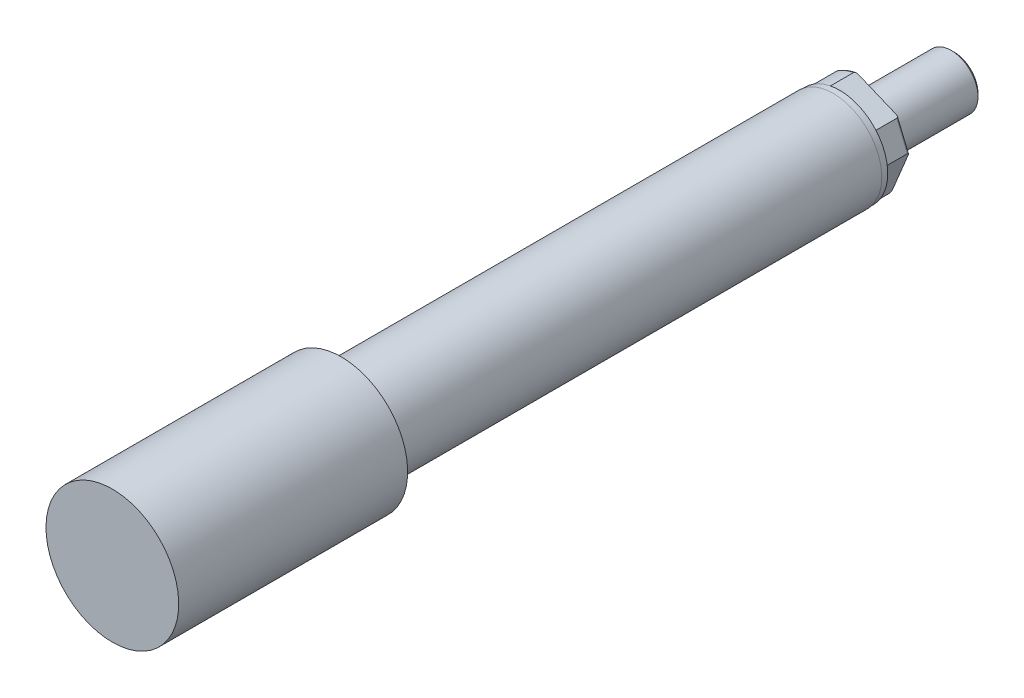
ISO-10303-21;
HEADER;
FILE_DESCRIPTION(('STEP AP214'),'2;1');
FILE_NAME('part.step','',(''),(''),'','','');
FILE_SCHEMA(('AUTOMOTIVE_DESIGN { 1 0 10303 214 1 1 1 1 }'));
ENDSEC;
DATA;
#1=APPLICATION_CONTEXT('core data for automotive mechanical design processes');
#2=APPLICATION_PROTOCOL_DEFINITION('international standard','automotive_design',2000,#1);
#3=PRODUCT_CONTEXT('',#1,'mechanical');
#4=PRODUCT('Part','Part','',(#3));
#5=PRODUCT_RELATED_PRODUCT_CATEGORY('part','',(#4));
#6=PRODUCT_DEFINITION_FORMATION('','',#4);
#7=PRODUCT_DEFINITION_CONTEXT('part definition',#1,'design');
#8=PRODUCT_DEFINITION('design','',#6,#7);
#9=PRODUCT_DEFINITION_SHAPE('','',#8);
#10=(LENGTH_UNIT() NAMED_UNIT(*) SI_UNIT(.MILLI.,.METRE.));
#11=(NAMED_UNIT(*) PLANE_ANGLE_UNIT() SI_UNIT($,.RADIAN.));
#12=(NAMED_UNIT(*) SI_UNIT($,.STERADIAN.) SOLID_ANGLE_UNIT());
#13=UNCERTAINTY_MEASURE_WITH_UNIT(LENGTH_MEASURE(1.E-05),#10,'distance_accuracy_value','');
#14=(GEOMETRIC_REPRESENTATION_CONTEXT(3) GLOBAL_UNCERTAINTY_ASSIGNED_CONTEXT((#13)) GLOBAL_UNIT_ASSIGNED_CONTEXT((#10,
#11,#12)) REPRESENTATION_CONTEXT('',''));
#15=CARTESIAN_POINT('',(0.,0.,0.));
#16=DIRECTION('',(0.,0.,1.));
#17=DIRECTION('',(1.,0.,0.));
#18=AXIS2_PLACEMENT_3D('',#15,#16,#17);
#19=CARTESIAN_POINT('',(0.,0.,-360.032799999));
#20=DIRECTION('',(0.,0.,1.));
#21=DIRECTION('',(0.923879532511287,-0.382683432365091,0.));
#22=AXIS2_PLACEMENT_3D('',#19,#20,#21);
#23=CYLINDRICAL_SURFACE('',#22,37.719);
#24=CARTESIAN_POINT('',(0.,0.,-420.179999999));
#25=DIRECTION('',(0.,0.,1.));
#26=DIRECTION('',(0.923879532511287,-0.382683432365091,0.));
#27=AXIS2_PLACEMENT_3D('',#24,#25,#26);
#28=CIRCLE('',#27,37.719);
#29=CARTESIAN_POINT('',(34.8478120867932,-14.4344363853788,-420.179999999));
#30=VERTEX_POINT('',#29);
#31=EDGE_CURVE('E137',#30,#30,#28,.T.);
#32=ORIENTED_EDGE('',*,*,#31,.F.);
#33=EDGE_LOOP('',(#32));
#34=FACE_BOUND('',#33,.T.);
#35=CARTESIAN_POINT('',(0.,0.,-425.179999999));
#36=DIRECTION('',(0.,0.,-1.));
#37=DIRECTION('',(-0.923879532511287,0.382683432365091,0.));
#38=AXIS2_PLACEMENT_3D('',#35,#36,#37);
#39=CIRCLE('',#38,37.719);
#40=CARTESIAN_POINT('',(-34.8478120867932,14.4344363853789,-425.179999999));
#41=VERTEX_POINT('',#40);
#42=EDGE_CURVE('E173',#41,#41,#39,.T.);
#43=ORIENTED_EDGE('',*,*,#42,.F.);
#44=EDGE_LOOP('',(#43));
#45=FACE_BOUND('',#44,.T.);
#46=ADVANCED_FACE('F16',(#34,#45),#23,.T.);
#47=CARTESIAN_POINT('',(14.4344363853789,34.8478120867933,-445.179999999));
#48=DIRECTION('',(0.,0.,1.));
#49=DIRECTION('',(0.923879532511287,-0.382683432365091,0.));
#50=AXIS2_PLACEMENT_3D('',#47,#48,#49);
#51=PLANE('',#50);
#52=CARTESIAN_POINT('',(0.,0.,-445.179999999));
#53=DIRECTION('',(0.,0.,1.));
#54=DIRECTION('',(0.923879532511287,-0.382683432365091,0.));
#55=AXIS2_PLACEMENT_3D('',#52,#53,#54);
#56=CIRCLE('',#55,18.495999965);
#57=CARTESIAN_POINT('',(17.088075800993,-7.07811275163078,-445.179999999));
#58=VERTEX_POINT('',#57);
#59=EDGE_CURVE('E158',#58,#58,#56,.T.);
#60=ORIENTED_EDGE('',*,*,#59,.T.);
#61=EDGE_LOOP('',(#60));
#62=FACE_BOUND('',#61,.T.);
#63=DIRECTION('',(0.923879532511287,-0.382683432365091,0.));
#64=VECTOR('',#63,1.);
#65=CARTESIAN_POINT('',(40.5034519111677,16.7770791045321,-445.179999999));
#66=LINE('',#65,#64);
#67=CARTESIAN_POINT('',(-4.93911886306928,35.6000082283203,-445.179999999));
#68=VERTEX_POINT('',#67);
#69=CARTESIAN_POINT('',(24.3744280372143,23.4579395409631,-445.179999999));
#70=VERTEX_POINT('',#69);
#71=EDGE_CURVE('E153',#68,#70,#66,.T.);
#72=ORIENTED_EDGE('',*,*,#71,.T.);
#73=DIRECTION('',(-0.382683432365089,0.923879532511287,0.));
#74=VECTOR('',#73,1.);
#75=CARTESIAN_POINT('',(18.8918219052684,36.6941216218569,-445.179999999));
#76=LINE('',#75,#74);
#77=CARTESIAN_POINT('',(33.8225914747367,0.648055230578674,-445.179999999));
#78=VERTEX_POINT('',#77);
#79=EDGE_CURVE('E269',#70,#78,#76,.F.);
#80=ORIENTED_EDGE('',*,*,#79,.T.);
#81=DIRECTION('',(-0.382683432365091,-0.923879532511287,0.));
#82=VECTOR('',#81,1.);
#83=CARTESIAN_POINT('',(40.5034519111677,16.7770791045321,-445.179999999));
#84=LINE('',#83,#82);
#85=CARTESIAN_POINT('',(21.6805227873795,-28.6654916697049,-445.179999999));
#86=VERTEX_POINT('',#85);
#87=EDGE_CURVE('E143',#78,#86,#84,.T.);
#88=ORIENTED_EDGE('',*,*,#87,.T.);
#89=CARTESIAN_POINT('',(0.,0.,-445.179999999));
#90=DIRECTION('',(0.,0.,1.));
#91=DIRECTION('',(0.923879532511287,-0.382683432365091,0.));
#92=AXIS2_PLACEMENT_3D('',#89,#90,#91);
#93=CIRCLE('',#92,35.941);
#94=CARTESIAN_POINT('',(4.93911886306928,-35.6000082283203,-445.179999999));
#95=VERTEX_POINT('',#94);
#96=EDGE_CURVE('E284',#86,#95,#93,.F.);
#97=ORIENTED_EDGE('',*,*,#96,.T.);
#98=DIRECTION('',(-0.923879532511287,0.382683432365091,0.));
#99=VECTOR('',#98,1.);
#100=CARTESIAN_POINT('',(16.7770791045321,-40.5034519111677,-445.179999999));
#101=LINE('',#100,#99);
#102=CARTESIAN_POINT('',(-28.6654916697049,-21.6805227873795,-445.179999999));
#103=VERTEX_POINT('',#102);
#104=EDGE_CURVE('E146',#95,#103,#101,.T.);
#105=ORIENTED_EDGE('',*,*,#104,.T.);
#106=CARTESIAN_POINT('',(0.,0.,-445.179999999));
#107=DIRECTION('',(0.,0.,1.));
#108=DIRECTION('',(0.923879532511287,-0.382683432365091,0.));
#109=AXIS2_PLACEMENT_3D('',#106,#107,#108);
#110=CIRCLE('',#109,35.941);
#111=CARTESIAN_POINT('',(-35.6000082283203,-4.93911886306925,-445.179999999));
#112=VERTEX_POINT('',#111);
#113=EDGE_CURVE('E282',#103,#112,#110,.F.);
#114=ORIENTED_EDGE('',*,*,#113,.T.);
#115=DIRECTION('',(0.382683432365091,0.923879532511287,0.));
#116=VECTOR('',#115,1.);
#117=CARTESIAN_POINT('',(-16.777079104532,40.5034519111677,-445.179999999));
#118=LINE('',#117,#116);
#119=CARTESIAN_POINT('',(-21.6805227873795,28.6654916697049,-445.179999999));
#120=VERTEX_POINT('',#119);
#121=EDGE_CURVE('E150',#112,#120,#118,.T.);
#122=ORIENTED_EDGE('',*,*,#121,.T.);
#123=CARTESIAN_POINT('',(0.,0.,-445.179999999));
#124=DIRECTION('',(0.,0.,1.));
#125=DIRECTION('',(0.923879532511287,-0.382683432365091,0.));
#126=AXIS2_PLACEMENT_3D('',#123,#124,#125);
#127=CIRCLE('',#126,35.941);
#128=EDGE_CURVE('E285',#120,#68,#127,.F.);
#129=ORIENTED_EDGE('',*,*,#128,.T.);
#130=EDGE_LOOP('',(#72,#80,#88,#97,#105,#114,#122,#129));
#131=FACE_BOUND('',#130,.T.);
#132=ADVANCED_FACE('F235',(#62,#131),#51,.F.);
#133=CARTESIAN_POINT('',(16.7770791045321,-40.5034519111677,-425.179999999));
#134=DIRECTION('',(-0.382683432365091,-0.923879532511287,0.));
#135=DIRECTION('',(0.,0.,-1.));
#136=AXIS2_PLACEMENT_3D('',#133,#134,#135);
#137=PLANE('',#136);
#138=ORIENTED_EDGE('',*,*,#104,.F.);
#139=CARTESIAN_POINT('',(4.93911886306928,-35.6000082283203,-445.179999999));
#140=CARTESIAN_POINT('',(4.99832987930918,-35.6245342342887,-445.179997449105));
#141=CARTESIAN_POINT('',(5.05753718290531,-35.6490587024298,-445.178965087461));
#142=CARTESIAN_POINT('',(5.17589592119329,-35.698084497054,-445.174771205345));
#143=CARTESIAN_POINT('',(5.23504734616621,-35.7225858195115,-445.171609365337));
#144=CARTESIAN_POINT('',(5.41269190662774,-35.7961686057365,-445.158798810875));
#145=CARTESIAN_POINT('',(5.53100031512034,-35.8451735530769,-445.145824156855));
#146=CARTESIAN_POINT('',(5.76714438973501,-35.9429876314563,-445.110075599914));
#147=CARTESIAN_POINT('',(5.88497196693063,-35.9917934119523,-445.087238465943));
#148=CARTESIAN_POINT('',(6.11821347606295,-36.0884052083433,-445.030530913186));
#149=CARTESIAN_POINT('',(6.23363092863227,-36.1362126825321,-444.996677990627));
#150=CARTESIAN_POINT('',(6.43254813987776,-36.2186068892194,-444.926075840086));
#151=CARTESIAN_POINT('',(6.51688700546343,-36.2535411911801,-444.89210972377));
#152=CARTESIAN_POINT('',(6.6823092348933,-36.322061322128,-444.815821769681));
#153=CARTESIAN_POINT('',(6.76339350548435,-36.3556475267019,-444.773502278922));
#154=CARTESIAN_POINT('',(6.92130537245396,-36.4210567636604,-444.678775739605));
#155=CARTESIAN_POINT('',(6.99809311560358,-36.452863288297,-444.626289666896));
#156=CARTESIAN_POINT('',(7.143873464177,-36.5132474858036,-444.509776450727));
#157=CARTESIAN_POINT('',(7.21288086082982,-36.5418312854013,-444.445771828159));
#158=CARTESIAN_POINT('',(7.31526105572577,-36.5842385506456,-444.330741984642));
#159=CARTESIAN_POINT('',(7.35238511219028,-36.5996158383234,-444.283646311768));
#160=CARTESIAN_POINT('',(7.41994876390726,-36.6276016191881,-444.184077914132));
#161=CARTESIAN_POINT('',(7.45039435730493,-36.6402125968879,-444.131610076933));
#162=CARTESIAN_POINT('',(7.49865078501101,-36.6602010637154,-444.029833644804));
#163=CARTESIAN_POINT('',(7.51766185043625,-36.6680757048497,-443.981197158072));
#164=CARTESIAN_POINT('',(7.54789053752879,-36.6805968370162,-443.88119484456));
#165=CARTESIAN_POINT('',(7.55912658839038,-36.6852509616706,-443.829835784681));
#166=CARTESIAN_POINT('',(7.56865990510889,-36.6891997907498,-443.757679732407));
#167=CARTESIAN_POINT('',(7.57066753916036,-36.6900313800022,-443.737405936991));
#168=CARTESIAN_POINT('',(7.57334922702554,-36.691142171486,-443.696758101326));
#169=CARTESIAN_POINT('',(7.57402345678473,-36.6914214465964,-443.676384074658));
#170=CARTESIAN_POINT('',(7.57402314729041,-36.6914213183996,-443.655999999));
#171=B_SPLINE_CURVE_WITH_KNOTS('',3,(#139,#140,#141,#142,#143,#144,#145,#146,#147,#148,#149,
#150,#151,#152,#153,#154,#155,#156,#157,#158,#159,#160,#161,#162,#163,#164,#165,#166,#167,#168,
#169,#170),.UNSPECIFIED.,.F.,.F.,(4,2,2,2,2,2,2,2,2,2,2,2,2,2,2,4),(0.,0.192251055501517,
0.384530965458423,0.77030604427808,1.15859203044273,1.54626429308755,1.83813426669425,
2.12992235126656,2.42407675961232,2.71766216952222,2.90288017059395,3.08793113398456,
3.24573831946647,3.4031701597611,3.4642978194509,3.52541741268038),.UNSPECIFIED.);
#172=CARTESIAN_POINT('',(7.5740231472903,-36.6914213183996,-443.655999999));
#173=VERTEX_POINT('',#172);
#174=EDGE_CURVE('E248',#95,#173,#171,.T.);
#175=ORIENTED_EDGE('',*,*,#174,.T.);
#176=DIRECTION('',(0.,0.,-1.));
#177=VECTOR('',#176,1.);
#178=CARTESIAN_POINT('',(7.5740231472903,-36.6914213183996,-317.427702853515));
#179=LINE('',#178,#177);
#180=CARTESIAN_POINT('',(7.5740231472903,-36.6914213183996,-425.179999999));
#181=VERTEX_POINT('',#180);
#182=EDGE_CURVE('E316',#173,#181,#179,.F.);
#183=ORIENTED_EDGE('',*,*,#182,.T.);
#184=DIRECTION('',(-0.923879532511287,0.382683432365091,0.));
#185=VECTOR('',#184,1.);
#186=CARTESIAN_POINT('',(16.7770791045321,-40.5034519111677,-425.179999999));
#187=LINE('',#186,#185);
#188=CARTESIAN_POINT('',(-31.3003959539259,-20.5891096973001,-425.179999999));
#189=VERTEX_POINT('',#188);
#190=EDGE_CURVE('E134',#181,#189,#187,.T.);
#191=ORIENTED_EDGE('',*,*,#190,.T.);
#192=DIRECTION('',(0.,0.,-1.));
#193=VECTOR('',#192,1.);
#194=CARTESIAN_POINT('',(-31.3003959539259,-20.5891096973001,-317.427702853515));
#195=LINE('',#194,#193);
#196=CARTESIAN_POINT('',(-31.3003959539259,-20.5891096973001,-443.655999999));
#197=VERTEX_POINT('',#196);
#198=EDGE_CURVE('E121',#189,#197,#195,.T.);
#199=ORIENTED_EDGE('',*,*,#198,.T.);
#200=CARTESIAN_POINT('',(-31.3003959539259,-20.5891096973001,-443.655999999));
#201=CARTESIAN_POINT('',(-31.3004118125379,-20.5891031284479,-443.686203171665));
#202=CARTESIAN_POINT('',(-31.2989193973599,-20.5897213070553,-443.716395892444));
#203=CARTESIAN_POINT('',(-31.2930415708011,-20.5921559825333,-443.776407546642));
#204=CARTESIAN_POINT('',(-31.2886603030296,-20.5939707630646,-443.806226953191));
#205=CARTESIAN_POINT('',(-31.2772021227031,-20.598716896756,-443.864846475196));
#206=CARTESIAN_POINT('',(-31.270160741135,-20.6016335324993,-443.893654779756));
#207=CARTESIAN_POINT('',(-31.2535839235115,-20.60849987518,-443.950415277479));
#208=CARTESIAN_POINT('',(-31.2440477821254,-20.6124498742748,-443.978367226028));
#209=CARTESIAN_POINT('',(-31.2121642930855,-20.6256564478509,-444.060335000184));
#210=CARTESIAN_POINT('',(-31.1864612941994,-20.6363029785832,-444.112849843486));
#211=CARTESIAN_POINT('',(-31.1279804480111,-20.6605265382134,-444.213146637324));
#212=CARTESIAN_POINT('',(-31.0951775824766,-20.6741139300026,-444.260910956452));
#213=CARTESIAN_POINT('',(-31.0037249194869,-20.711994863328,-444.377743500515));
#214=CARTESIAN_POINT('',(-30.9410998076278,-20.7379350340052,-444.443153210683));
#215=CARTESIAN_POINT('',(-30.8074439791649,-20.7932970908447,-444.562855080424));
#216=CARTESIAN_POINT('',(-30.7363963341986,-20.8227259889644,-444.617124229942));
#217=CARTESIAN_POINT('',(-30.5996359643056,-20.8793739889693,-444.708806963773));
#218=CARTESIAN_POINT('',(-30.5346551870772,-20.9062899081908,-444.747524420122));
#219=CARTESIAN_POINT('',(-30.4018382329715,-20.9613044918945,-444.81879354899));
#220=CARTESIAN_POINT('',(-30.3339999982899,-20.989404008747,-444.851340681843));
#221=CARTESIAN_POINT('',(-30.1960424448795,-21.0465478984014,-444.911059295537));
#222=CARTESIAN_POINT('',(-30.1259151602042,-21.0755955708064,-444.938208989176));
#223=CARTESIAN_POINT('',(-29.9841814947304,-21.1343035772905,-444.987552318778));
#224=CARTESIAN_POINT('',(-29.9125747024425,-21.1639640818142,-445.009744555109));
#225=CARTESIAN_POINT('',(-29.7438693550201,-21.2338441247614,-445.056387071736));
#226=CARTESIAN_POINT('',(-29.646350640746,-21.2742376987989,-445.079056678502));
#227=CARTESIAN_POINT('',(-29.4500861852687,-21.3555330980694,-445.117195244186));
#228=CARTESIAN_POINT('',(-29.3513397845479,-21.3964351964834,-445.132660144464));
#229=CARTESIAN_POINT('',(-29.1548151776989,-21.4778383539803,-445.156800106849));
#230=CARTESIAN_POINT('',(-29.0570481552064,-21.5183347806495,-445.165583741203));
#231=CARTESIAN_POINT('',(-28.861343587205,-21.5993982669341,-445.177167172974));
#232=CARTESIAN_POINT('',(-28.7634064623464,-21.6399651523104,-445.17997519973));
#233=CARTESIAN_POINT('',(-28.6654916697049,-21.6805227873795,-445.179999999));
#234=B_SPLINE_CURVE_WITH_KNOTS('',3,(#200,#201,#202,#203,#204,#205,#206,#207,#208,#209,#210,
#211,#212,#213,#214,#215,#216,#217,#218,#219,#220,#221,#222,#223,#224,#225,#226,#227,#228,#229,
#230,#231,#232,#233),.UNSPECIFIED.,.F.,.F.,(4,2,2,2,2,2,2,2,2,2,2,2,2,2,2,2,4),(0.,
0.0905495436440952,0.180969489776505,0.270222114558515,0.359500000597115,0.536883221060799,
0.714901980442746,0.995893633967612,1.27745994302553,1.5179835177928,1.75868337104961,
2.00033593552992,2.2420566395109,2.56564116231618,2.88940775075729,3.20779349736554,
3.52574049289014),.UNSPECIFIED.);
#235=EDGE_CURVE('E242',#197,#103,#234,.T.);
#236=ORIENTED_EDGE('',*,*,#235,.T.);
#237=EDGE_LOOP('',(#138,#175,#183,#191,#199,#236));
#238=FACE_BOUND('',#237,.T.);
#239=ADVANCED_FACE('F230',(#238),#137,.T.);
#240=CARTESIAN_POINT('',(-16.777079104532,40.5034519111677,-425.179999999));
#241=DIRECTION('',(-0.923879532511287,0.382683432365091,0.));
#242=DIRECTION('',(-0.382683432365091,-0.923879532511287,0.));
#243=AXIS2_PLACEMENT_3D('',#240,#241,#242);
#244=PLANE('',#243);
#245=ORIENTED_EDGE('',*,*,#121,.F.);
#246=CARTESIAN_POINT('',(-35.6000082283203,-4.93911886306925,-445.179999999));
#247=CARTESIAN_POINT('',(-35.6245342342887,-4.99832987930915,-445.179997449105));
#248=CARTESIAN_POINT('',(-35.6490587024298,-5.05753718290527,-445.178965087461));
#249=CARTESIAN_POINT('',(-35.698084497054,-5.17589592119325,-445.174771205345));
#250=CARTESIAN_POINT('',(-35.7225858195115,-5.23504734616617,-445.171609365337));
#251=CARTESIAN_POINT('',(-35.7961686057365,-5.41269190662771,-445.158798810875));
#252=CARTESIAN_POINT('',(-35.8451735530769,-5.53100031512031,-445.145824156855));
#253=CARTESIAN_POINT('',(-35.9429876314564,-5.76714438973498,-445.110075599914));
#254=CARTESIAN_POINT('',(-35.9917934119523,-5.88497196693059,-445.087238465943));
#255=CARTESIAN_POINT('',(-36.0884052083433,-6.11821347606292,-445.030530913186));
#256=CARTESIAN_POINT('',(-36.1362126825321,-6.23363092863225,-444.996677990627));
#257=CARTESIAN_POINT('',(-36.2186068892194,-6.43254813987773,-444.926075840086));
#258=CARTESIAN_POINT('',(-36.2535411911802,-6.51688700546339,-444.89210972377));
#259=CARTESIAN_POINT('',(-36.322061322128,-6.68230923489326,-444.815821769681));
#260=CARTESIAN_POINT('',(-36.355647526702,-6.76339350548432,-444.773502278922));
#261=CARTESIAN_POINT('',(-36.4210567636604,-6.92130537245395,-444.678775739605));
#262=CARTESIAN_POINT('',(-36.452863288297,-6.99809311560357,-444.626289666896));
#263=CARTESIAN_POINT('',(-36.5132474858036,-7.14387346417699,-444.509776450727));
#264=CARTESIAN_POINT('',(-36.5418312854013,-7.21288086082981,-444.445771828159));
#265=CARTESIAN_POINT('',(-36.5842385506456,-7.31526105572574,-444.330741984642));
#266=CARTESIAN_POINT('',(-36.5996158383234,-7.35238511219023,-444.283646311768));
#267=CARTESIAN_POINT('',(-36.6276016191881,-7.41994876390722,-444.184077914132));
#268=CARTESIAN_POINT('',(-36.6402125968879,-7.45039435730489,-444.131610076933));
#269=CARTESIAN_POINT('',(-36.6602010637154,-7.49865078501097,-444.029833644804));
#270=CARTESIAN_POINT('',(-36.6680757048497,-7.5176618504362,-443.981197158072));
#271=CARTESIAN_POINT('',(-36.6805968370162,-7.54789053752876,-443.88119484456));
#272=CARTESIAN_POINT('',(-36.6852509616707,-7.55912658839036,-443.829835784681));
#273=CARTESIAN_POINT('',(-36.6891997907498,-7.56865990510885,-443.757679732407));
#274=CARTESIAN_POINT('',(-36.6900313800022,-7.57066753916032,-443.737405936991));
#275=CARTESIAN_POINT('',(-36.691142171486,-7.5733492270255,-443.696758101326));
#276=CARTESIAN_POINT('',(-36.6914214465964,-7.57402345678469,-443.676384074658));
#277=CARTESIAN_POINT('',(-36.6914213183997,-7.57402314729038,-443.655999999));
#278=B_SPLINE_CURVE_WITH_KNOTS('',3,(#246,#247,#248,#249,#250,#251,#252,#253,#254,#255,#256,
#257,#258,#259,#260,#261,#262,#263,#264,#265,#266,#267,#268,#269,#270,#271,#272,#273,#274,#275,
#276,#277),.UNSPECIFIED.,.F.,.F.,(4,2,2,2,2,2,2,2,2,2,2,2,2,2,2,4),(0.,0.192251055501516,
0.384530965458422,0.77030604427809,1.15859203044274,1.54626429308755,1.83813426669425,
2.12992235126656,2.42407675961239,2.71766216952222,2.90288017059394,3.08793113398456,
3.24573831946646,3.4031701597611,3.4642978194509,3.52541741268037),.UNSPECIFIED.);
#279=CARTESIAN_POINT('',(-36.6914213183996,-7.57402314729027,-443.655999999));
#280=VERTEX_POINT('',#279);
#281=EDGE_CURVE('E33',#112,#280,#278,.T.);
#282=ORIENTED_EDGE('',*,*,#281,.T.);
#283=DIRECTION('',(0.,0.,-1.));
#284=VECTOR('',#283,1.);
#285=CARTESIAN_POINT('',(-36.6914213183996,-7.57402314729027,-317.427702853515));
#286=LINE('',#285,#284);
#287=CARTESIAN_POINT('',(-36.6914213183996,-7.57402314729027,-425.179999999));
#288=VERTEX_POINT('',#287);
#289=EDGE_CURVE('E107',#280,#288,#286,.F.);
#290=ORIENTED_EDGE('',*,*,#289,.T.);
#291=DIRECTION('',(0.382683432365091,0.923879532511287,0.));
#292=VECTOR('',#291,1.);
#293=CARTESIAN_POINT('',(-16.777079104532,40.5034519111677,-425.179999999));
#294=LINE('',#293,#292);
#295=CARTESIAN_POINT('',(-20.5891096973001,31.3003959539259,-425.179999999));
#296=VERTEX_POINT('',#295);
#297=EDGE_CURVE('E111',#288,#296,#294,.T.);
#298=ORIENTED_EDGE('',*,*,#297,.T.);
#299=DIRECTION('',(0.,0.,-1.));
#300=VECTOR('',#299,1.);
#301=CARTESIAN_POINT('',(-20.5891096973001,31.3003959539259,-317.427702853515));
#302=LINE('',#301,#300);
#303=CARTESIAN_POINT('',(-20.5891096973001,31.3003959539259,-443.655999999));
#304=VERTEX_POINT('',#303);
#305=EDGE_CURVE('E114',#296,#304,#302,.T.);
#306=ORIENTED_EDGE('',*,*,#305,.T.);
#307=CARTESIAN_POINT('',(-20.5891096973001,31.3003959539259,-443.655999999));
#308=CARTESIAN_POINT('',(-20.5891031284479,31.300411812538,-443.686203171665));
#309=CARTESIAN_POINT('',(-20.5897213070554,31.2989193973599,-443.716395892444));
#310=CARTESIAN_POINT('',(-20.5921559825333,31.2930415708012,-443.776407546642));
#311=CARTESIAN_POINT('',(-20.5939707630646,31.2886603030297,-443.806226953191));
#312=CARTESIAN_POINT('',(-20.598716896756,31.2772021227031,-443.864846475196));
#313=CARTESIAN_POINT('',(-20.6016335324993,31.270160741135,-443.893654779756));
#314=CARTESIAN_POINT('',(-20.60849987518,31.2535839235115,-443.950415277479));
#315=CARTESIAN_POINT('',(-20.6124498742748,31.2440477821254,-443.978367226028));
#316=CARTESIAN_POINT('',(-20.6256564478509,31.2121642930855,-444.060335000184));
#317=CARTESIAN_POINT('',(-20.6363029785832,31.1864612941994,-444.112849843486));
#318=CARTESIAN_POINT('',(-20.6605265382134,31.1279804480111,-444.213146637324));
#319=CARTESIAN_POINT('',(-20.6741139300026,31.0951775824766,-444.260910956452));
#320=CARTESIAN_POINT('',(-20.711994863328,31.003724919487,-444.377743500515));
#321=CARTESIAN_POINT('',(-20.7379350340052,30.9410998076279,-444.443153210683));
#322=CARTESIAN_POINT('',(-20.7932970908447,30.8074439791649,-444.562855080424));
#323=CARTESIAN_POINT('',(-20.8227259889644,30.7363963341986,-444.617124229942));
#324=CARTESIAN_POINT('',(-20.8793739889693,30.5996359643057,-444.708806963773));
#325=CARTESIAN_POINT('',(-20.9062899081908,30.5346551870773,-444.747524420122));
#326=CARTESIAN_POINT('',(-20.9613044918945,30.4018382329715,-444.81879354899));
#327=CARTESIAN_POINT('',(-20.989404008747,30.33399999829,-444.851340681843));
#328=CARTESIAN_POINT('',(-21.0465478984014,30.1960424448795,-444.911059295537));
#329=CARTESIAN_POINT('',(-21.0755955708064,30.1259151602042,-444.938208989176));
#330=CARTESIAN_POINT('',(-21.1343035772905,29.9841814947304,-444.987552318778));
#331=CARTESIAN_POINT('',(-21.1639640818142,29.9125747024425,-445.009744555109));
#332=CARTESIAN_POINT('',(-21.2338441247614,29.7438693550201,-445.056387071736));
#333=CARTESIAN_POINT('',(-21.2742376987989,29.6463506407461,-445.079056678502));
#334=CARTESIAN_POINT('',(-21.3555330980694,29.4500861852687,-445.117195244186));
#335=CARTESIAN_POINT('',(-21.3964351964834,29.3513397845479,-445.132660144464));
#336=CARTESIAN_POINT('',(-21.4778383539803,29.1548151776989,-445.156800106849));
#337=CARTESIAN_POINT('',(-21.5183347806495,29.0570481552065,-445.165583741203));
#338=CARTESIAN_POINT('',(-21.5993982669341,28.861343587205,-445.177167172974));
#339=CARTESIAN_POINT('',(-21.6399651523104,28.7634064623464,-445.17997519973));
#340=CARTESIAN_POINT('',(-21.6805227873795,28.6654916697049,-445.179999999));
#341=B_SPLINE_CURVE_WITH_KNOTS('',3,(#307,#308,#309,#310,#311,#312,#313,#314,#315,#316,#317,
#318,#319,#320,#321,#322,#323,#324,#325,#326,#327,#328,#329,#330,#331,#332,#333,#334,#335,#336,
#337,#338,#339,#340),.UNSPECIFIED.,.F.,.F.,(4,2,2,2,2,2,2,2,2,2,2,2,2,2,2,2,4),(0.,
0.0905495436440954,0.180969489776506,0.270222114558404,0.359500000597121,0.536883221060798,
0.714901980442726,0.995893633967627,1.2774599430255,1.51798351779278,1.75868337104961,
2.00033593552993,2.24205663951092,2.56564116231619,2.8894077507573,3.20779349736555,
3.52574049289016),.UNSPECIFIED.);
#342=EDGE_CURVE('E213',#304,#120,#341,.T.);
#343=ORIENTED_EDGE('',*,*,#342,.T.);
#344=EDGE_LOOP('',(#245,#282,#290,#298,#306,#343));
#345=FACE_BOUND('',#344,.T.);
#346=ADVANCED_FACE('F109',(#345),#244,.T.);
#347=CARTESIAN_POINT('',(40.5034519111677,16.7770791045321,-425.179999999));
#348=DIRECTION('',(0.382683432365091,0.923879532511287,0.));
#349=DIRECTION('',(0.,0.,1.));
#350=AXIS2_PLACEMENT_3D('',#347,#348,#349);
#351=PLANE('',#350);
#352=DIRECTION('',(0.,0.,1.));
#353=VECTOR('',#352,1.);
#354=CARTESIAN_POINT('',(26.3656299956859,22.6331566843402,-425.179999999));
#355=LINE('',#354,#353);
#356=CARTESIAN_POINT('',(26.3656299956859,22.6331566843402,-443.655999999));
#357=VERTEX_POINT('',#356);
#358=CARTESIAN_POINT('',(26.3656299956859,22.6331566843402,-425.179999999));
#359=VERTEX_POINT('',#358);
#360=EDGE_CURVE('E292',#357,#359,#355,.T.);
#361=ORIENTED_EDGE('',*,*,#360,.F.);
#362=CARTESIAN_POINT('',(24.3744280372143,23.4579395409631,-443.655999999));
#363=DIRECTION('',(0.382683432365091,0.923879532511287,0.));
#364=DIRECTION('',(-0.923879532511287,0.382683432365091,0.));
#365=AXIS2_PLACEMENT_3D('',#362,#363,#364);
#366=ELLIPSE('',#365,2.15526146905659,1.524);
#367=EDGE_CURVE('E193',#357,#70,#366,.T.);
#368=ORIENTED_EDGE('',*,*,#367,.T.);
#369=ORIENTED_EDGE('',*,*,#71,.F.);
#370=CARTESIAN_POINT('',(-4.93911886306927,35.6000082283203,-445.179999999));
#371=CARTESIAN_POINT('',(-4.99832987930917,35.6245342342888,-445.179997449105));
#372=CARTESIAN_POINT('',(-5.0575371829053,35.6490587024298,-445.178965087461));
#373=CARTESIAN_POINT('',(-5.17589592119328,35.6980844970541,-445.174771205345));
#374=CARTESIAN_POINT('',(-5.2350473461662,35.7225858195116,-445.171609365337));
#375=CARTESIAN_POINT('',(-5.41269190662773,35.7961686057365,-445.158798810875));
#376=CARTESIAN_POINT('',(-5.53100031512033,35.845173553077,-445.145824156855));
#377=CARTESIAN_POINT('',(-5.767144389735,35.9429876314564,-445.110075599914));
#378=CARTESIAN_POINT('',(-5.88497196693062,35.9917934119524,-445.087238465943));
#379=CARTESIAN_POINT('',(-6.11821347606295,36.0884052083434,-445.030530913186));
#380=CARTESIAN_POINT('',(-6.23363092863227,36.1362126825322,-444.996677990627));
#381=CARTESIAN_POINT('',(-6.43254813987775,36.2186068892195,-444.926075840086));
#382=CARTESIAN_POINT('',(-6.51688700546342,36.2535411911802,-444.89210972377));
#383=CARTESIAN_POINT('',(-6.68230923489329,36.322061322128,-444.815821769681));
#384=CARTESIAN_POINT('',(-6.76339350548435,36.355647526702,-444.773502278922));
#385=CARTESIAN_POINT('',(-6.92130537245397,36.4210567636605,-444.678775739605));
#386=CARTESIAN_POINT('',(-6.99809311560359,36.452863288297,-444.626289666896));
#387=CARTESIAN_POINT('',(-7.14387346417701,36.5132474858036,-444.509776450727));
#388=CARTESIAN_POINT('',(-7.21288086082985,36.5418312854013,-444.445771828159));
#389=CARTESIAN_POINT('',(-7.31526105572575,36.5842385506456,-444.330741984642));
#390=CARTESIAN_POINT('',(-7.35238511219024,36.5996158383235,-444.283646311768));
#391=CARTESIAN_POINT('',(-7.41994876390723,36.6276016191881,-444.184077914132));
#392=CARTESIAN_POINT('',(-7.45039435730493,36.640212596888,-444.131610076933));
#393=CARTESIAN_POINT('',(-7.49865078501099,36.6602010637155,-444.029833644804));
#394=CARTESIAN_POINT('',(-7.5176618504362,36.6680757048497,-443.981197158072));
#395=CARTESIAN_POINT('',(-7.54789053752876,36.6805968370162,-443.88119484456));
#396=CARTESIAN_POINT('',(-7.55912658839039,36.6852509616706,-443.829835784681));
#397=CARTESIAN_POINT('',(-7.56865990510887,36.6891997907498,-443.757679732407));
#398=CARTESIAN_POINT('',(-7.57066753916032,36.6900313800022,-443.737405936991));
#399=CARTESIAN_POINT('',(-7.57334922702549,36.691142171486,-443.696758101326));
#400=CARTESIAN_POINT('',(-7.57402345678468,36.6914214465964,-443.676384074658));
#401=CARTESIAN_POINT('',(-7.5740231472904,36.6914213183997,-443.655999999));
#402=B_SPLINE_CURVE_WITH_KNOTS('',3,(#370,#371,#372,#373,#374,#375,#376,#377,#378,#379,#380,
#381,#382,#383,#384,#385,#386,#387,#388,#389,#390,#391,#392,#393,#394,#395,#396,#397,#398,#399,
#400,#401),.UNSPECIFIED.,.F.,.F.,(4,2,2,2,2,2,2,2,2,2,2,2,2,2,2,4),(0.,0.192251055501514,
0.384530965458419,0.770306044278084,1.15859203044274,1.54626429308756,1.83813426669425,
2.12992235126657,2.42407675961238,2.71766216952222,2.90288017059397,3.08793113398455,
3.24573831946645,3.40317015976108,3.46429781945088,3.52541741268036),.UNSPECIFIED.);
#403=CARTESIAN_POINT('',(-7.57402314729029,36.6914213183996,-443.655999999));
#404=VERTEX_POINT('',#403);
#405=EDGE_CURVE('E185',#68,#404,#402,.T.);
#406=ORIENTED_EDGE('',*,*,#405,.T.);
#407=DIRECTION('',(0.,0.,-1.));
#408=VECTOR('',#407,1.);
#409=CARTESIAN_POINT('',(-7.57402314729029,36.6914213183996,-317.427702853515));
#410=LINE('',#409,#408);
#411=CARTESIAN_POINT('',(-7.57402314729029,36.6914213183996,-425.179999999));
#412=VERTEX_POINT('',#411);
#413=EDGE_CURVE('E115',#404,#412,#410,.F.);
#414=ORIENTED_EDGE('',*,*,#413,.T.);
#415=DIRECTION('',(0.923879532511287,-0.382683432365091,0.));
#416=VECTOR('',#415,1.);
#417=CARTESIAN_POINT('',(40.5034519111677,16.7770791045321,-425.179999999));
#418=LINE('',#417,#416);
#419=EDGE_CURVE('E133',#412,#359,#418,.T.);
#420=ORIENTED_EDGE('',*,*,#419,.T.);
#421=EDGE_LOOP('',(#361,#368,#369,#406,#414,#420));
#422=FACE_BOUND('',#421,.T.);
#423=ADVANCED_FACE('F195',(#422),#351,.T.);
#424=CARTESIAN_POINT('',(40.5034519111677,16.7770791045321,-425.179999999));
#425=DIRECTION('',(0.923879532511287,-0.382683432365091,0.));
#426=DIRECTION('',(0.382683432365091,0.923879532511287,0.));
#427=AXIS2_PLACEMENT_3D('',#424,#425,#426);
#428=PLANE('',#427);
#429=ORIENTED_EDGE('',*,*,#87,.F.);
#430=CARTESIAN_POINT('',(33.8225914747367,0.648055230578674,-443.655999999));
#431=DIRECTION('',(0.923879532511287,-0.382683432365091,0.));
#432=DIRECTION('',(0.382683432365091,0.923879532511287,0.));
#433=AXIS2_PLACEMENT_3D('',#430,#431,#432);
#434=ELLIPSE('',#433,2.15526146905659,1.524);
#435=CARTESIAN_POINT('',(34.6473743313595,2.63925718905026,-443.655999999));
#436=VERTEX_POINT('',#435);
#437=EDGE_CURVE('E268',#78,#436,#434,.T.);
#438=ORIENTED_EDGE('',*,*,#437,.T.);
#439=DIRECTION('',(0.,0.,-1.));
#440=VECTOR('',#439,1.);
#441=CARTESIAN_POINT('',(34.6473743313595,2.63925718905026,-425.179999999));
#442=LINE('',#441,#440);
#443=CARTESIAN_POINT('',(34.6473743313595,2.63925718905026,-425.179999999));
#444=VERTEX_POINT('',#443);
#445=EDGE_CURVE('E176',#444,#436,#442,.T.);
#446=ORIENTED_EDGE('',*,*,#445,.F.);
#447=DIRECTION('',(-0.382683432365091,-0.923879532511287,0.));
#448=VECTOR('',#447,1.);
#449=CARTESIAN_POINT('',(40.5034519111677,16.7770791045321,-425.179999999));
#450=LINE('',#449,#448);
#451=CARTESIAN_POINT('',(20.5891096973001,-31.3003959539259,-425.179999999));
#452=VERTEX_POINT('',#451);
#453=EDGE_CURVE('E139',#444,#452,#450,.T.);
#454=ORIENTED_EDGE('',*,*,#453,.T.);
#455=DIRECTION('',(0.,0.,-1.));
#456=VECTOR('',#455,1.);
#457=CARTESIAN_POINT('',(20.5891096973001,-31.3003959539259,-317.427702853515));
#458=LINE('',#457,#456);
#459=CARTESIAN_POINT('',(20.5891096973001,-31.3003959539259,-443.655999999));
#460=VERTEX_POINT('',#459);
#461=EDGE_CURVE('E179',#452,#460,#458,.T.);
#462=ORIENTED_EDGE('',*,*,#461,.T.);
#463=CARTESIAN_POINT('',(20.5891096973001,-31.3003959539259,-443.655999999));
#464=CARTESIAN_POINT('',(20.589103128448,-31.3004118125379,-443.686203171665));
#465=CARTESIAN_POINT('',(20.5897213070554,-31.2989193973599,-443.716395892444));
#466=CARTESIAN_POINT('',(20.5921559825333,-31.2930415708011,-443.776407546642));
#467=CARTESIAN_POINT('',(20.5939707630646,-31.2886603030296,-443.806226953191));
#468=CARTESIAN_POINT('',(20.598716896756,-31.2772021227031,-443.864846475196));
#469=CARTESIAN_POINT('',(20.6016335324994,-31.270160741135,-443.893654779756));
#470=CARTESIAN_POINT('',(20.60849987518,-31.2535839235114,-443.950415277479));
#471=CARTESIAN_POINT('',(20.6124498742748,-31.2440477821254,-443.978367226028));
#472=CARTESIAN_POINT('',(20.6256564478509,-31.2121642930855,-444.060335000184));
#473=CARTESIAN_POINT('',(20.6363029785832,-31.1864612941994,-444.112849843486));
#474=CARTESIAN_POINT('',(20.6605265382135,-31.1279804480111,-444.213146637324));
#475=CARTESIAN_POINT('',(20.6741139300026,-31.0951775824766,-444.260910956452));
#476=CARTESIAN_POINT('',(20.711994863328,-31.0037249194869,-444.377743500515));
#477=CARTESIAN_POINT('',(20.7379350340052,-30.9410998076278,-444.443153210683));
#478=CARTESIAN_POINT('',(20.7932970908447,-30.8074439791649,-444.562855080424));
#479=CARTESIAN_POINT('',(20.8227259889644,-30.7363963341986,-444.617124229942));
#480=CARTESIAN_POINT('',(20.8793739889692,-30.5996359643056,-444.708806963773));
#481=CARTESIAN_POINT('',(20.9062899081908,-30.5346551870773,-444.747524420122));
#482=CARTESIAN_POINT('',(20.9613044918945,-30.4018382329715,-444.81879354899));
#483=CARTESIAN_POINT('',(20.989404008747,-30.3339999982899,-444.851340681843));
#484=CARTESIAN_POINT('',(21.0465478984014,-30.1960424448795,-444.911059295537));
#485=CARTESIAN_POINT('',(21.0755955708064,-30.1259151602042,-444.938208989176));
#486=CARTESIAN_POINT('',(21.1343035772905,-29.9841814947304,-444.987552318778));
#487=CARTESIAN_POINT('',(21.1639640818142,-29.9125747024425,-445.009744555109));
#488=CARTESIAN_POINT('',(21.2338441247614,-29.7438693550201,-445.056387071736));
#489=CARTESIAN_POINT('',(21.2742376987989,-29.646350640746,-445.079056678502));
#490=CARTESIAN_POINT('',(21.3555330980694,-29.4500861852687,-445.117195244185));
#491=CARTESIAN_POINT('',(21.3964351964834,-29.3513397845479,-445.132660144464));
#492=CARTESIAN_POINT('',(21.4778383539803,-29.154815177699,-445.156800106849));
#493=CARTESIAN_POINT('',(21.5183347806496,-29.0570481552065,-445.165583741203));
#494=CARTESIAN_POINT('',(21.5993982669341,-28.861343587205,-445.177167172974));
#495=CARTESIAN_POINT('',(21.6399651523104,-28.7634064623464,-445.17997519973));
#496=CARTESIAN_POINT('',(21.6805227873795,-28.6654916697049,-445.179999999));
#497=B_SPLINE_CURVE_WITH_KNOTS('',3,(#463,#464,#465,#466,#467,#468,#469,#470,#471,#472,#473,
#474,#475,#476,#477,#478,#479,#480,#481,#482,#483,#484,#485,#486,#487,#488,#489,#490,#491,#492,
#493,#494,#495,#496),.UNSPECIFIED.,.F.,.F.,(4,2,2,2,2,2,2,2,2,2,2,2,2,2,2,2,4),(0.,
0.0905495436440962,0.180969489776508,0.27022211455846,0.359500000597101,0.53688322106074,
0.714901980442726,0.995893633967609,1.27745994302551,1.51798351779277,1.75868337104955,
2.00033593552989,2.24205663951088,2.56564116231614,2.88940775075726,3.20779349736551,
3.52574049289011),.UNSPECIFIED.);
#498=EDGE_CURVE('E262',#460,#86,#497,.T.);
#499=ORIENTED_EDGE('',*,*,#498,.T.);
#500=EDGE_LOOP('',(#429,#438,#446,#454,#462,#499));
#501=FACE_BOUND('',#500,.T.);
#502=ADVANCED_FACE('F237',(#501),#428,.T.);
#503=CARTESIAN_POINT('',(0.,0.,-515.029999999));
#504=DIRECTION('',(0.,0.,1.));
#505=DIRECTION('',(0.923879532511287,-0.382683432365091,0.));
#506=AXIS2_PLACEMENT_3D('',#503,#504,#505);
#507=PLANE('',#506);
#508=CARTESIAN_POINT('',(0.,0.,-515.029999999));
#509=DIRECTION('',(0.,0.,1.));
#510=DIRECTION('',(0.923879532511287,-0.382683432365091,0.));
#511=AXIS2_PLACEMENT_3D('',#508,#509,#510);
#512=CIRCLE('',#511,2.9845);
#513=CARTESIAN_POINT('',(2.75731846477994,-1.14211870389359,-515.029999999));
#514=VERTEX_POINT('',#513);
#515=EDGE_CURVE('E147',#514,#514,#512,.T.);
#516=ORIENTED_EDGE('',*,*,#515,.T.);
#517=EDGE_LOOP('',(#516));
#518=FACE_BOUND('',#517,.T.);
#519=CARTESIAN_POINT('',(0.,0.,-515.029999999));
#520=DIRECTION('',(0.,0.,1.));
#521=DIRECTION('',(0.923879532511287,-0.382683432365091,0.));
#522=AXIS2_PLACEMENT_3D('',#519,#520,#521);
#523=CIRCLE('',#522,18.714);
#524=CARTESIAN_POINT('',(17.2894815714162,-7.16153775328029,-515.029999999));
#525=VERTEX_POINT('',#524);
#526=EDGE_CURVE('E170',#525,#525,#523,.F.);
#527=ORIENTED_EDGE('',*,*,#526,.T.);
#528=EDGE_LOOP('',(#527));
#529=FACE_BOUND('',#528,.T.);
#530=ADVANCED_FACE('F581',(#518,#529),#507,.F.);
#531=CARTESIAN_POINT('',(0.,0.,-360.032799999));
#532=DIRECTION('',(0.,0.,1.));
#533=DIRECTION('',(0.923879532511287,-0.382683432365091,0.));
#534=AXIS2_PLACEMENT_3D('',#531,#532,#533);
#535=CYLINDRICAL_SURFACE('',#534,21.);
#536=CARTESIAN_POINT('',(0.,0.,-512.743999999));
#537=DIRECTION('',(0.,0.,1.));
#538=DIRECTION('',(0.923879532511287,-0.382683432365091,0.));
#539=AXIS2_PLACEMENT_3D('',#536,#537,#538);
#540=CIRCLE('',#539,21.);
#541=CARTESIAN_POINT('',(19.401470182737,-8.03635207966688,-512.743999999));
#542=VERTEX_POINT('',#541);
#543=EDGE_CURVE('E167',#542,#542,#540,.T.);
#544=ORIENTED_EDGE('',*,*,#543,.T.);
#545=EDGE_LOOP('',(#544));
#546=FACE_BOUND('',#545,.T.);
#547=CARTESIAN_POINT('',(0.,0.,-451.783999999));
#548=DIRECTION('',(0.,0.,1.));
#549=DIRECTION('',(0.923879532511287,-0.382683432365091,0.));
#550=AXIS2_PLACEMENT_3D('',#547,#548,#549);
#551=CIRCLE('',#550,21.);
#552=CARTESIAN_POINT('',(19.401470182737,-8.03635207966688,-451.783999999));
#553=VERTEX_POINT('',#552);
#554=EDGE_CURVE('E164',#553,#553,#551,.T.);
#555=ORIENTED_EDGE('',*,*,#554,.F.);
#556=EDGE_LOOP('',(#555));
#557=FACE_BOUND('',#556,.T.);
#558=ADVANCED_FACE('F570',(#546,#557),#535,.T.);
#559=CARTESIAN_POINT('',(8.03635207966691,19.4014701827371,-451.783999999));
#560=DIRECTION('',(0.,0.,-1.));
#561=DIRECTION('',(-0.923879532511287,0.382683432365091,0.));
#562=AXIS2_PLACEMENT_3D('',#559,#560,#561);
#563=PLANE('',#562);
#564=CARTESIAN_POINT('',(0.,0.,-451.783999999));
#565=DIRECTION('',(0.,0.,1.));
#566=DIRECTION('',(0.923879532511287,-0.382683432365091,0.));
#567=AXIS2_PLACEMENT_3D('',#564,#565,#566);
#568=CIRCLE('',#567,18.495999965);
#569=CARTESIAN_POINT('',(17.088075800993,-7.07811275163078,-451.783999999));
#570=VERTEX_POINT('',#569);
#571=EDGE_CURVE('E161',#570,#570,#568,.T.);
#572=ORIENTED_EDGE('',*,*,#571,.F.);
#573=EDGE_LOOP('',(#572));
#574=FACE_BOUND('',#573,.T.);
#575=ORIENTED_EDGE('',*,*,#554,.T.);
#576=EDGE_LOOP('',(#575));
#577=FACE_BOUND('',#576,.T.);
#578=ADVANCED_FACE('F559',(#574,#577),#563,.F.);
#579=CARTESIAN_POINT('',(0.,0.,-360.032799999));
#580=DIRECTION('',(0.,0.,1.));
#581=DIRECTION('',(0.923879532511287,-0.382683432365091,0.));
#582=AXIS2_PLACEMENT_3D('',#579,#580,#581);
#583=CYLINDRICAL_SURFACE('',#582,18.495999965);
#584=ORIENTED_EDGE('',*,*,#59,.F.);
#585=EDGE_LOOP('',(#584));
#586=FACE_BOUND('',#585,.T.);
#587=ORIENTED_EDGE('',*,*,#571,.T.);
#588=EDGE_LOOP('',(#587));
#589=FACE_BOUND('',#588,.T.);
#590=ADVANCED_FACE('F549',(#586,#589),#583,.T.);
#591=CARTESIAN_POINT('',(0.,0.,-512.743999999));
#592=DIRECTION('',(0.,0.,1.));
#593=DIRECTION('',(0.923879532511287,-0.382683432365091,0.));
#594=AXIS2_PLACEMENT_3D('',#591,#592,#593);
#595=CONICAL_SURFACE('',#594,21.,0.785398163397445);
#596=ORIENTED_EDGE('',*,*,#526,.F.);
#597=EDGE_LOOP('',(#596));
#598=FACE_BOUND('',#597,.T.);
#599=ORIENTED_EDGE('',*,*,#543,.F.);
#600=EDGE_LOOP('',(#599));
#601=FACE_BOUND('',#600,.T.);
#602=ADVANCED_FACE('F540',(#598,#601),#595,.T.);
#603=CARTESIAN_POINT('',(0.,0.,-425.179999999));
#604=DIRECTION('',(0.,0.,-1.));
#605=DIRECTION('',(-0.923879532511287,0.382683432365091,0.));
#606=AXIS2_PLACEMENT_3D('',#603,#604,#605);
#607=PLANE('',#606);
#608=CARTESIAN_POINT('',(0.,0.,-425.179999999));
#609=DIRECTION('',(0.,0.,-1.));
#610=DIRECTION('',(-0.923879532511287,0.382683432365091,0.));
#611=AXIS2_PLACEMENT_3D('',#608,#609,#610);
#612=CIRCLE('',#611,37.465);
#613=EDGE_CURVE('E118',#288,#189,#612,.F.);
#614=ORIENTED_EDGE('',*,*,#613,.T.);
#615=ORIENTED_EDGE('',*,*,#190,.F.);
#616=EDGE_CURVE('E125',#181,#452,#612,.F.);
#617=ORIENTED_EDGE('',*,*,#616,.T.);
#618=ORIENTED_EDGE('',*,*,#453,.F.);
#619=DIRECTION('',(0.382683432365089,-0.923879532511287,0.));
#620=VECTOR('',#619,1.);
#621=CARTESIAN_POINT('',(23.5294520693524,29.4802958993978,-425.179999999));
#622=LINE('',#621,#620);
#623=EDGE_CURVE('E299',#359,#444,#622,.T.);
#624=ORIENTED_EDGE('',*,*,#623,.F.);
#625=ORIENTED_EDGE('',*,*,#419,.F.);
#626=EDGE_CURVE('E127',#412,#296,#612,.F.);
#627=ORIENTED_EDGE('',*,*,#626,.T.);
#628=ORIENTED_EDGE('',*,*,#297,.F.);
#629=EDGE_LOOP('',(#614,#615,#617,#618,#624,#625,#627,#628));
#630=FACE_BOUND('',#629,.T.);
#631=ORIENTED_EDGE('',*,*,#42,.T.);
#632=EDGE_LOOP('',(#631));
#633=FACE_BOUND('',#632,.T.);
#634=ADVANCED_FACE('F129',(#630,#633),#607,.T.);
#635=CARTESIAN_POINT('',(0.,0.,-515.029999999));
#636=DIRECTION('',(0.,0.,-1.));
#637=DIRECTION('',(-0.923879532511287,0.382683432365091,0.));
#638=AXIS2_PLACEMENT_3D('',#635,#636,#637);
#639=CONICAL_SURFACE('',#638,2.9845,0.523598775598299);
#640=CARTESIAN_POINT('',(0.,0.,-512.610325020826));
#641=DIRECTION('',(0.,0.,1.));
#642=DIRECTION('',(0.923879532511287,-0.382683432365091,0.));
#643=AXIS2_PLACEMENT_3D('',#640,#641,#642);
#644=CIRCLE('',#643,1.5875);
#645=CARTESIAN_POINT('',(1.46665875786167,-0.607509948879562,-512.610325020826));
#646=VERTEX_POINT('',#645);
#647=EDGE_CURVE('E307',#646,#646,#644,.T.);
#648=ORIENTED_EDGE('',*,*,#647,.T.);
#649=EDGE_LOOP('',(#648));
#650=FACE_BOUND('',#649,.T.);
#651=ORIENTED_EDGE('',*,*,#515,.F.);
#652=EDGE_LOOP('',(#651));
#653=FACE_BOUND('',#652,.T.);
#654=ADVANCED_FACE('F520',(#650,#653),#639,.F.);
#655=CARTESIAN_POINT('',(0.,0.,-515.029999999));
#656=DIRECTION('',(0.,0.,1.));
#657=DIRECTION('',(0.923879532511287,-0.382683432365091,0.));
#658=AXIS2_PLACEMENT_3D('',#655,#656,#657);
#659=CYLINDRICAL_SURFACE('',#658,1.5875);
#660=CARTESIAN_POINT('',(0.,0.,-509.310468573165));
#661=DIRECTION('',(0.,0.,1.));
#662=DIRECTION('',(0.923879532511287,-0.382683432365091,0.));
#663=AXIS2_PLACEMENT_3D('',#660,#661,#662);
#664=CIRCLE('',#663,1.5875);
#665=CARTESIAN_POINT('',(1.46665875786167,-0.607509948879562,-509.310468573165));
#666=VERTEX_POINT('',#665);
#667=EDGE_CURVE('E310',#666,#666,#664,.T.);
#668=ORIENTED_EDGE('',*,*,#667,.T.);
#669=EDGE_LOOP('',(#668));
#670=FACE_BOUND('',#669,.T.);
#671=ORIENTED_EDGE('',*,*,#647,.F.);
#672=EDGE_LOOP('',(#671));
#673=FACE_BOUND('',#672,.T.);
#674=ADVANCED_FACE('F509',(#670,#673),#659,.F.);
#675=CARTESIAN_POINT('',(0.,0.,-509.310468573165));
#676=DIRECTION('',(0.,0.,-1.));
#677=DIRECTION('',(-0.923879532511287,0.382683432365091,0.));
#678=AXIS2_PLACEMENT_3D('',#675,#676,#677);
#679=CONICAL_SURFACE('',#678,1.5875,1.0471975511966);
#680=CARTESIAN_POINT('',(0.,0.,-508.393925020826));
#681=VERTEX_POINT('',#680);
#682=VERTEX_LOOP('',#681);
#683=FACE_BOUND('',#682,.T.);
#684=ORIENTED_EDGE('',*,*,#667,.F.);
#685=EDGE_LOOP('',(#684));
#686=FACE_BOUND('',#685,.T.);
#687=ADVANCED_FACE('F499',(#683,#686),#679,.F.);
#688=CARTESIAN_POINT('',(23.5294520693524,29.4802958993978,-388.716178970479));
#689=DIRECTION('',(-0.923879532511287,-0.382683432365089,0.));
#690=DIRECTION('',(0.382683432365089,-0.923879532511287,0.));
#691=AXIS2_PLACEMENT_3D('',#688,#689,#690);
#692=PLANE('',#691);
#693=ORIENTED_EDGE('',*,*,#445,.T.);
#694=DIRECTION('',(-0.382683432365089,0.923879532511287,0.));
#695=VECTOR('',#694,1.);
#696=CARTESIAN_POINT('',(23.5294520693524,29.4802958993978,-443.655999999));
#697=LINE('',#696,#695);
#698=EDGE_CURVE('E182',#436,#357,#697,.T.);
#699=ORIENTED_EDGE('',*,*,#698,.T.);
#700=ORIENTED_EDGE('',*,*,#360,.T.);
#701=ORIENTED_EDGE('',*,*,#623,.T.);
#702=EDGE_LOOP('',(#693,#699,#700,#701));
#703=FACE_BOUND('',#702,.T.);
#704=ADVANCED_FACE('F297',(#703),#692,.F.);
#705=CARTESIAN_POINT('',(0.,0.,-317.427702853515));
#706=DIRECTION('',(0.,0.,-1.));
#707=DIRECTION('',(-0.923879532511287,0.382683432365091,0.));
#708=AXIS2_PLACEMENT_3D('',#705,#706,#707);
#709=CYLINDRICAL_SURFACE('',#708,37.465);
#710=ORIENTED_EDGE('',*,*,#182,.F.);
#711=CARTESIAN_POINT('',(0.,0.,-443.655999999));
#712=DIRECTION('',(0.,0.,1.));
#713=DIRECTION('',(0.923879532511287,-0.382683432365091,0.));
#714=AXIS2_PLACEMENT_3D('',#711,#712,#713);
#715=CIRCLE('',#714,37.465);
#716=EDGE_CURVE('E220',#173,#460,#715,.T.);
#717=ORIENTED_EDGE('',*,*,#716,.T.);
#718=ORIENTED_EDGE('',*,*,#461,.F.);
#719=ORIENTED_EDGE('',*,*,#616,.F.);
#720=EDGE_LOOP('',(#710,#717,#718,#719));
#721=FACE_BOUND('',#720,.T.);
#722=ADVANCED_FACE('F473',(#721),#709,.T.);
#723=ORIENTED_EDGE('',*,*,#413,.F.);
#724=CARTESIAN_POINT('',(0.,0.,-443.655999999));
#725=DIRECTION('',(0.,0.,1.));
#726=DIRECTION('',(0.923879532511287,-0.382683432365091,0.));
#727=AXIS2_PLACEMENT_3D('',#724,#725,#726);
#728=CIRCLE('',#727,37.465);
#729=EDGE_CURVE('E10',#404,#304,#728,.T.);
#730=ORIENTED_EDGE('',*,*,#729,.T.);
#731=ORIENTED_EDGE('',*,*,#305,.F.);
#732=ORIENTED_EDGE('',*,*,#626,.F.);
#733=EDGE_LOOP('',(#723,#730,#731,#732));
#734=FACE_BOUND('',#733,.T.);
#735=ADVANCED_FACE('F319',(#734),#709,.T.);
#736=ORIENTED_EDGE('',*,*,#289,.F.);
#737=CARTESIAN_POINT('',(0.,0.,-443.655999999));
#738=DIRECTION('',(0.,0.,1.));
#739=DIRECTION('',(0.923879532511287,-0.382683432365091,0.));
#740=AXIS2_PLACEMENT_3D('',#737,#738,#739);
#741=CIRCLE('',#740,37.465);
#742=EDGE_CURVE('E25',#280,#197,#741,.T.);
#743=ORIENTED_EDGE('',*,*,#742,.T.);
#744=ORIENTED_EDGE('',*,*,#198,.F.);
#745=ORIENTED_EDGE('',*,*,#613,.F.);
#746=EDGE_LOOP('',(#736,#743,#744,#745));
#747=FACE_BOUND('',#746,.T.);
#748=ADVANCED_FACE('F119',(#747),#709,.T.);
#749=CARTESIAN_POINT('',(22.1214596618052,28.8970863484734,-443.655999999));
#750=DIRECTION('',(-0.382683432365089,0.923879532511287,0.));
#751=DIRECTION('',(-0.923879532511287,-0.382683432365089,0.));
#752=AXIS2_PLACEMENT_3D('',#749,#750,#751);
#753=CYLINDRICAL_SURFACE('',#752,1.524);
#754=ORIENTED_EDGE('',*,*,#437,.F.);
#755=ORIENTED_EDGE('',*,*,#79,.F.);
#756=ORIENTED_EDGE('',*,*,#367,.F.);
#757=ORIENTED_EDGE('',*,*,#698,.F.);
#758=EDGE_LOOP('',(#754,#755,#756,#757));
#759=FACE_BOUND('',#758,.T.);
#760=ADVANCED_FACE('F257',(#759),#753,.T.);
#761=CARTESIAN_POINT('',(0.,0.,-443.655999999));
#762=DIRECTION('',(0.,0.,1.));
#763=DIRECTION('',(0.923879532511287,-0.382683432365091,0.));
#764=AXIS2_PLACEMENT_3D('',#761,#762,#763);
#765=TOROIDAL_SURFACE('',#764,35.941,1.524);
#766=ORIENTED_EDGE('',*,*,#498,.F.);
#767=ORIENTED_EDGE('',*,*,#716,.F.);
#768=ORIENTED_EDGE('',*,*,#174,.F.);
#769=ORIENTED_EDGE('',*,*,#96,.F.);
#770=EDGE_LOOP('',(#766,#767,#768,#769));
#771=FACE_BOUND('',#770,.T.);
#772=ADVANCED_FACE('F253',(#771),#765,.T.);
#773=CARTESIAN_POINT('',(0.,0.,-443.655999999));
#774=DIRECTION('',(0.,0.,1.));
#775=DIRECTION('',(0.923879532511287,-0.382683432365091,0.));
#776=AXIS2_PLACEMENT_3D('',#773,#774,#775);
#777=TOROIDAL_SURFACE('',#776,35.941,1.524);
#778=ORIENTED_EDGE('',*,*,#235,.F.);
#779=ORIENTED_EDGE('',*,*,#742,.F.);
#780=ORIENTED_EDGE('',*,*,#281,.F.);
#781=ORIENTED_EDGE('',*,*,#113,.F.);
#782=EDGE_LOOP('',(#778,#779,#780,#781));
#783=FACE_BOUND('',#782,.T.);
#784=ADVANCED_FACE('F205',(#783),#777,.T.);
#785=CARTESIAN_POINT('',(0.,0.,-443.655999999));
#786=DIRECTION('',(0.,0.,1.));
#787=DIRECTION('',(0.923879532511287,-0.382683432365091,0.));
#788=AXIS2_PLACEMENT_3D('',#785,#786,#787);
#789=TOROIDAL_SURFACE('',#788,35.941,1.524);
#790=ORIENTED_EDGE('',*,*,#342,.F.);
#791=ORIENTED_EDGE('',*,*,#729,.F.);
#792=ORIENTED_EDGE('',*,*,#405,.F.);
#793=ORIENTED_EDGE('',*,*,#128,.F.);
#794=EDGE_LOOP('',(#790,#791,#792,#793));
#795=FACE_BOUND('',#794,.T.);
#796=ADVANCED_FACE('F199',(#795),#789,.T.);
#797=CARTESIAN_POINT('',(0.,0.,145.54073));
#798=DIRECTION('',(0.,0.,-1.));
#799=DIRECTION('',(-0.923879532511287,0.382683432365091,0.));
#800=AXIS2_PLACEMENT_3D('',#797,#798,#799);
#801=PLANE('',#800);
#802=CARTESIAN_POINT('',(0.,0.,145.54073));
#803=DIRECTION('',(0.,0.,-1.));
#804=DIRECTION('',(-0.923879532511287,0.382683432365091,0.));
#805=AXIS2_PLACEMENT_3D('',#802,#803,#804);
#806=CIRCLE('',#805,52.07);
#807=CARTESIAN_POINT('',(-48.1064072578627,19.9263263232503,145.54073));
#808=VERTEX_POINT('',#807);
#809=EDGE_CURVE('E330',#808,#808,#806,.T.);
#810=ORIENTED_EDGE('',*,*,#809,.F.);
#811=EDGE_LOOP('',(#810));
#812=FACE_BOUND('',#811,.T.);
#813=ADVANCED_FACE('F204',(#812),#801,.F.);
#814=CARTESIAN_POINT('',(0.,0.,145.54073));
#815=DIRECTION('',(0.,0.,-1.));
#816=DIRECTION('',(-0.923879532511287,0.382683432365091,0.));
#817=AXIS2_PLACEMENT_3D('',#814,#815,#816);
#818=CYLINDRICAL_SURFACE('',#817,52.07);
#819=ORIENTED_EDGE('',*,*,#809,.T.);
#820=EDGE_LOOP('',(#819));
#821=FACE_BOUND('',#820,.T.);
#822=CARTESIAN_POINT('',(0.,0.,-34.1122));
#823=DIRECTION('',(0.,0.,-1.));
#824=DIRECTION('',(-0.923879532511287,0.382683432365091,0.));
#825=AXIS2_PLACEMENT_3D('',#822,#823,#824);
#826=CIRCLE('',#825,52.07);
#827=CARTESIAN_POINT('',(-48.1064072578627,19.9263263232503,-34.1122));
#828=VERTEX_POINT('',#827);
#829=EDGE_CURVE('E329',#828,#828,#826,.T.);
#830=ORIENTED_EDGE('',*,*,#829,.F.);
#831=EDGE_LOOP('',(#830));
#832=FACE_BOUND('',#831,.T.);
#833=ADVANCED_FACE('F349',(#821,#832),#818,.T.);
#834=CARTESIAN_POINT('',(0.,0.,-34.1122));
#835=DIRECTION('',(0.,0.,-1.));
#836=DIRECTION('',(-0.923879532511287,0.382683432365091,0.));
#837=AXIS2_PLACEMENT_3D('',#834,#835,#836);
#838=PLANE('',#837);
#839=CARTESIAN_POINT('',(0.,0.,-34.1122));
#840=DIRECTION('',(0.,0.,1.));
#841=DIRECTION('',(0.923879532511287,-0.382683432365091,0.));
#842=AXIS2_PLACEMENT_3D('',#839,#840,#841);
#843=CIRCLE('',#842,42.7863);
#844=CARTESIAN_POINT('',(39.5293868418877,-16.3736081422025,-34.1122));
#845=VERTEX_POINT('',#844);
#846=EDGE_CURVE('E20',#845,#845,#843,.F.);
#847=ORIENTED_EDGE('',*,*,#846,.F.);
#848=EDGE_LOOP('',(#847));
#849=FACE_BOUND('',#848,.T.);
#850=ORIENTED_EDGE('',*,*,#829,.T.);
#851=EDGE_LOOP('',(#850));
#852=FACE_BOUND('',#851,.T.);
#853=ADVANCED_FACE('F345',(#849,#852),#838,.T.);
#854=CARTESIAN_POINT('',(0.,0.,-38.8747));
#855=DIRECTION('',(0.,0.,1.));
#856=DIRECTION('',(0.923879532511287,-0.382683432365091,0.));
#857=AXIS2_PLACEMENT_3D('',#854,#855,#856);
#858=TOROIDAL_SURFACE('',#857,42.7863,4.7625);
#859=CARTESIAN_POINT('',(0.,0.,-38.3595807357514));
#860=DIRECTION('',(0.,0.,-1.));
#861=DIRECTION('',(-0.923879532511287,0.382683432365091,0.));
#862=AXIS2_PLACEMENT_3D('',#859,#860,#861);
#863=CIRCLE('',#862,38.05174);
#864=CARTESIAN_POINT('',(-35.155223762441,14.561770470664,-38.3595807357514));
#865=VERTEX_POINT('',#864);
#866=EDGE_CURVE('E320',#865,#865,#863,.F.);
#867=ORIENTED_EDGE('',*,*,#866,.T.);
#868=EDGE_LOOP('',(#867));
#869=FACE_BOUND('',#868,.T.);
#870=ORIENTED_EDGE('',*,*,#846,.T.);
#871=EDGE_LOOP('',(#870));
#872=FACE_BOUND('',#871,.T.);
#873=ADVANCED_FACE('F209',(#869,#872),#858,.F.);
#874=CARTESIAN_POINT('',(0.,0.,-137.653201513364));
#875=DIRECTION('',(0.,0.,1.));
#876=DIRECTION('',(0.923879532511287,-0.382683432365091,0.));
#877=AXIS2_PLACEMENT_3D('',#874,#875,#876);
#878=CYLINDRICAL_SURFACE('',#877,38.05174);
#879=ORIENTED_EDGE('',*,*,#866,.F.);
#880=EDGE_LOOP('',(#879));
#881=FACE_BOUND('',#880,.T.);
#882=CARTESIAN_POINT('',(0.,0.,-420.179999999));
#883=DIRECTION('',(0.,0.,1.));
#884=DIRECTION('',(0.923879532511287,-0.382683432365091,0.));
#885=AXIS2_PLACEMENT_3D('',#882,#883,#884);
#886=CIRCLE('',#885,38.05174);
#887=CARTESIAN_POINT('',(35.155223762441,-14.561770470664,-420.179999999));
#888=VERTEX_POINT('',#887);
#889=EDGE_CURVE('E326',#888,#888,#886,.T.);
#890=ORIENTED_EDGE('',*,*,#889,.T.);
#891=EDGE_LOOP('',(#890));
#892=FACE_BOUND('',#891,.T.);
#893=ADVANCED_FACE('F18',(#881,#892),#878,.T.);
#894=CARTESIAN_POINT('',(0.,0.,-420.179999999));
#895=DIRECTION('',(0.,0.,1.));
#896=DIRECTION('',(0.923879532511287,-0.382683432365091,0.));
#897=AXIS2_PLACEMENT_3D('',#894,#895,#896);
#898=PLANE('',#897);
#899=ORIENTED_EDGE('',*,*,#31,.T.);
#900=EDGE_LOOP('',(#899));
#901=FACE_BOUND('',#900,.T.);
#902=ORIENTED_EDGE('',*,*,#889,.F.);
#903=EDGE_LOOP('',(#902));
#904=FACE_BOUND('',#903,.T.);
#905=ADVANCED_FACE('F336',(#901,#904),#898,.F.);
#906=CLOSED_SHELL('',(#46,#132,#239,#346,#423,#502,#530,#558,#578,#590,#602,#634,#654,#674,#687,
#704,#722,#735,#748,#760,#772,#784,#796,#813,#833,#853,#873,#893,#905));
#907=MANIFOLD_SOLID_BREP('B1',#906);
#908=ADVANCED_BREP_SHAPE_REPRESENTATION('',(#18,#907),#14);
#909=SHAPE_DEFINITION_REPRESENTATION(#9,#908);
ENDSEC;
END-ISO-10303-21;
